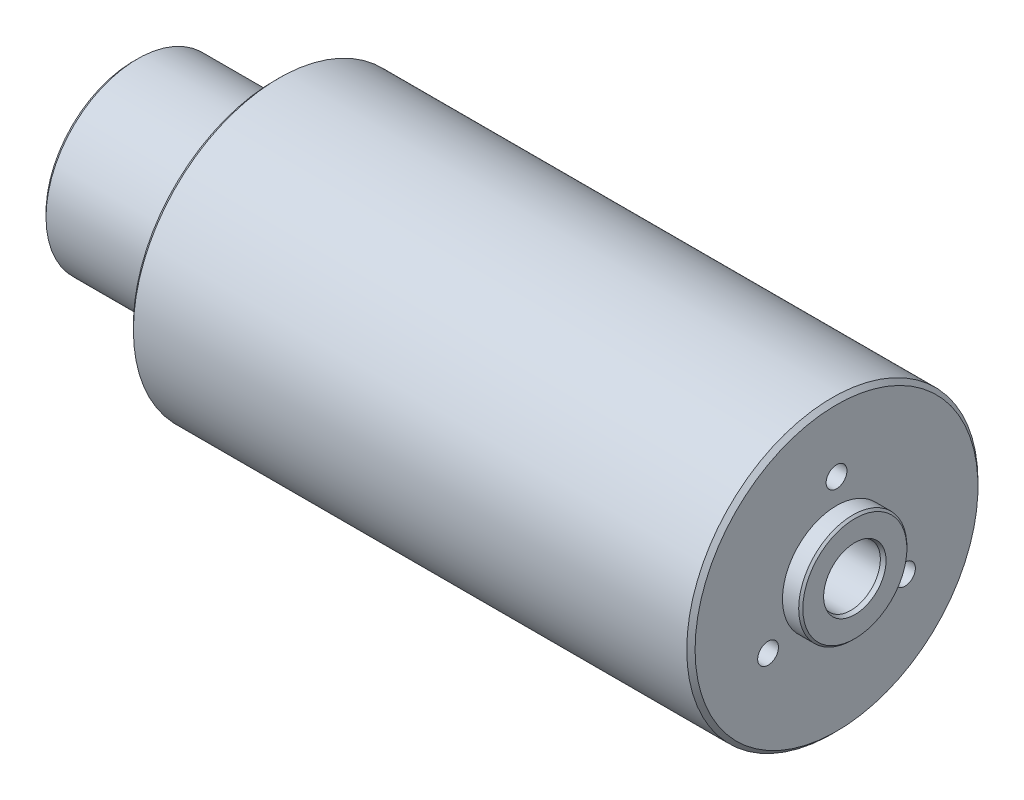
ISO-10303-21;
HEADER;
FILE_DESCRIPTION(('STEP AP214'),'2;1');
FILE_NAME('part.step','',(''),(''),'','','');
FILE_SCHEMA(('AUTOMOTIVE_DESIGN { 1 0 10303 214 1 1 1 1 }'));
ENDSEC;
DATA;
#1=APPLICATION_CONTEXT('core data for automotive mechanical design processes');
#2=APPLICATION_PROTOCOL_DEFINITION('international standard','automotive_design',2000,#1);
#3=PRODUCT_CONTEXT('',#1,'mechanical');
#4=PRODUCT('Part','Part','',(#3));
#5=PRODUCT_RELATED_PRODUCT_CATEGORY('part','',(#4));
#6=PRODUCT_DEFINITION_FORMATION('','',#4);
#7=PRODUCT_DEFINITION_CONTEXT('part definition',#1,'design');
#8=PRODUCT_DEFINITION('design','',#6,#7);
#9=PRODUCT_DEFINITION_SHAPE('','',#8);
#10=(LENGTH_UNIT() NAMED_UNIT(*) SI_UNIT(.MILLI.,.METRE.));
#11=(NAMED_UNIT(*) PLANE_ANGLE_UNIT() SI_UNIT($,.RADIAN.));
#12=(NAMED_UNIT(*) SI_UNIT($,.STERADIAN.) SOLID_ANGLE_UNIT());
#13=UNCERTAINTY_MEASURE_WITH_UNIT(LENGTH_MEASURE(1.E-05),#10,'distance_accuracy_value','');
#14=(GEOMETRIC_REPRESENTATION_CONTEXT(3) GLOBAL_UNCERTAINTY_ASSIGNED_CONTEXT((#13)) GLOBAL_UNIT_ASSIGNED_CONTEXT((#10,
#11,#12)) REPRESENTATION_CONTEXT('',''));
#15=CARTESIAN_POINT('',(0.,0.,0.));
#16=DIRECTION('',(0.,0.,1.));
#17=DIRECTION('',(1.,0.,0.));
#18=AXIS2_PLACEMENT_3D('',#15,#16,#17);
#19=CARTESIAN_POINT('',(-84.5007135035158,11.,0.));
#20=DIRECTION('',(1.,0.,0.));
#21=DIRECTION('',(0.,0.,-1.));
#22=AXIS2_PLACEMENT_3D('',#19,#20,#21);
#23=PLANE('',#22);
#24=CARTESIAN_POINT('',(-84.5007135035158,0.,0.));
#25=DIRECTION('',(1.,0.,0.));
#26=DIRECTION('',(0.,0.,-1.));
#27=AXIS2_PLACEMENT_3D('',#24,#25,#26);
#28=CIRCLE('',#27,10.5);
#29=CARTESIAN_POINT('',(-84.5007135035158,0.,-10.5));
#30=VERTEX_POINT('',#29);
#31=EDGE_CURVE('E119',#30,#30,#28,.F.);
#32=ORIENTED_EDGE('',*,*,#31,.T.);
#33=EDGE_LOOP('',(#32));
#34=FACE_BOUND('',#33,.T.);
#35=ADVANCED_FACE('F34',(#34),#23,.F.);
#36=CARTESIAN_POINT('',(-71.1251521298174,0.,0.));
#37=DIRECTION('',(-1.,0.,0.));
#38=DIRECTION('',(0.,0.,1.));
#39=AXIS2_PLACEMENT_3D('',#36,#37,#38);
#40=CYLINDRICAL_SURFACE('',#39,11.);
#41=CARTESIAN_POINT('',(-84.0007135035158,0.,0.));
#42=DIRECTION('',(1.,0.,0.));
#43=DIRECTION('',(0.,0.,-1.));
#44=AXIS2_PLACEMENT_3D('',#41,#42,#43);
#45=CIRCLE('',#44,11.);
#46=CARTESIAN_POINT('',(-84.0007135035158,0.,-11.));
#47=VERTEX_POINT('',#46);
#48=EDGE_CURVE('E122',#47,#47,#45,.T.);
#49=ORIENTED_EDGE('',*,*,#48,.T.);
#50=EDGE_LOOP('',(#49));
#51=FACE_BOUND('',#50,.T.);
#52=CARTESIAN_POINT('',(-67.5007135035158,0.,0.));
#53=DIRECTION('',(-1.,0.,0.));
#54=DIRECTION('',(0.,0.,1.));
#55=AXIS2_PLACEMENT_3D('',#52,#53,#54);
#56=CIRCLE('',#55,11.);
#57=CARTESIAN_POINT('',(-67.5007135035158,0.,11.));
#58=VERTEX_POINT('',#57);
#59=EDGE_CURVE('E110',#58,#58,#56,.T.);
#60=ORIENTED_EDGE('',*,*,#59,.T.);
#61=EDGE_LOOP('',(#60));
#62=FACE_BOUND('',#61,.T.);
#63=ADVANCED_FACE('F146',(#51,#62),#40,.T.);
#64=CARTESIAN_POINT('',(-67.5007135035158,17.5,0.));
#65=DIRECTION('',(1.,0.,0.));
#66=DIRECTION('',(0.,0.,-1.));
#67=AXIS2_PLACEMENT_3D('',#64,#65,#66);
#68=PLANE('',#67);
#69=CARTESIAN_POINT('',(-67.5007135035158,0.,0.));
#70=DIRECTION('',(1.,0.,0.));
#71=DIRECTION('',(0.,0.,-1.));
#72=AXIS2_PLACEMENT_3D('',#69,#70,#71);
#73=CIRCLE('',#72,17.);
#74=CARTESIAN_POINT('',(-67.5007135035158,0.,-17.));
#75=VERTEX_POINT('',#74);
#76=EDGE_CURVE('E125',#75,#75,#73,.F.);
#77=ORIENTED_EDGE('',*,*,#76,.T.);
#78=EDGE_LOOP('',(#77));
#79=FACE_BOUND('',#78,.T.);
#80=ORIENTED_EDGE('',*,*,#59,.F.);
#81=EDGE_LOOP('',(#80));
#82=FACE_BOUND('',#81,.T.);
#83=ADVANCED_FACE('F143',(#79,#82),#68,.F.);
#84=CARTESIAN_POINT('',(-71.1251521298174,0.,0.));
#85=DIRECTION('',(-1.,0.,0.));
#86=DIRECTION('',(0.,0.,1.));
#87=AXIS2_PLACEMENT_3D('',#84,#85,#86);
#88=CYLINDRICAL_SURFACE('',#87,17.5);
#89=CARTESIAN_POINT('',(-67.0007135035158,0.,0.));
#90=DIRECTION('',(1.,0.,0.));
#91=DIRECTION('',(0.,0.,-1.));
#92=AXIS2_PLACEMENT_3D('',#89,#90,#91);
#93=CIRCLE('',#92,17.5);
#94=CARTESIAN_POINT('',(-67.0007135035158,0.,-17.5));
#95=VERTEX_POINT('',#94);
#96=EDGE_CURVE('E41',#95,#95,#93,.T.);
#97=ORIENTED_EDGE('',*,*,#96,.T.);
#98=EDGE_LOOP('',(#97));
#99=FACE_BOUND('',#98,.T.);
#100=CARTESIAN_POINT('',(-0.5,0.,0.));
#101=DIRECTION('',(-1.,0.,0.));
#102=DIRECTION('',(0.,0.,1.));
#103=AXIS2_PLACEMENT_3D('',#100,#101,#102);
#104=CIRCLE('',#103,17.5);
#105=CARTESIAN_POINT('',(-0.5,0.,17.5));
#106=VERTEX_POINT('',#105);
#107=EDGE_CURVE('E128',#106,#106,#104,.T.);
#108=ORIENTED_EDGE('',*,*,#107,.T.);
#109=EDGE_LOOP('',(#108));
#110=FACE_BOUND('',#109,.T.);
#111=ADVANCED_FACE('F133',(#99,#110),#88,.T.);
#112=CARTESIAN_POINT('',(0.,6.5,0.));
#113=DIRECTION('',(-1.,0.,0.));
#114=DIRECTION('',(0.,0.,1.));
#115=AXIS2_PLACEMENT_3D('',#112,#113,#114);
#116=PLANE('',#115);
#117=CARTESIAN_POINT('',(0.,0.,0.));
#118=DIRECTION('',(-1.,0.,0.));
#119=DIRECTION('',(0.,0.,1.));
#120=AXIS2_PLACEMENT_3D('',#117,#118,#119);
#121=CIRCLE('',#120,17.);
#122=CARTESIAN_POINT('',(0.,0.,17.));
#123=VERTEX_POINT('',#122);
#124=EDGE_CURVE('E11',#123,#123,#121,.F.);
#125=ORIENTED_EDGE('',*,*,#124,.T.);
#126=EDGE_LOOP('',(#125));
#127=FACE_BOUND('',#126,.T.);
#128=CARTESIAN_POINT('',(0.,-4.74999999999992,8.22724133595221));
#129=DIRECTION('',(1.,0.,0.));
#130=DIRECTION('',(0.,0.,-1.));
#131=AXIS2_PLACEMENT_3D('',#128,#129,#130);
#132=CIRCLE('',#131,1.25);
#133=CARTESIAN_POINT('',(0.,-4.74999999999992,6.97724133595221));
#134=VERTEX_POINT('',#133);
#135=EDGE_CURVE('E80',#134,#134,#132,.T.);
#136=ORIENTED_EDGE('',*,*,#135,.F.);
#137=EDGE_LOOP('',(#136));
#138=FACE_BOUND('',#137,.T.);
#139=CARTESIAN_POINT('',(0.,-4.75000000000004,-8.22724133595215));
#140=DIRECTION('',(1.,0.,0.));
#141=DIRECTION('',(0.,0.,-1.));
#142=AXIS2_PLACEMENT_3D('',#139,#140,#141);
#143=CIRCLE('',#142,1.25);
#144=CARTESIAN_POINT('',(0.,-4.75000000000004,-9.47724133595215));
#145=VERTEX_POINT('',#144);
#146=EDGE_CURVE('E92',#145,#145,#143,.T.);
#147=ORIENTED_EDGE('',*,*,#146,.F.);
#148=EDGE_LOOP('',(#147));
#149=FACE_BOUND('',#148,.T.);
#150=CARTESIAN_POINT('',(0.,9.5,0.));
#151=DIRECTION('',(1.,0.,0.));
#152=DIRECTION('',(0.,0.,-1.));
#153=AXIS2_PLACEMENT_3D('',#150,#151,#152);
#154=CIRCLE('',#153,1.25);
#155=CARTESIAN_POINT('',(0.,9.5,-1.25));
#156=VERTEX_POINT('',#155);
#157=EDGE_CURVE('E104',#156,#156,#154,.T.);
#158=ORIENTED_EDGE('',*,*,#157,.F.);
#159=EDGE_LOOP('',(#158));
#160=FACE_BOUND('',#159,.T.);
#161=CARTESIAN_POINT('',(0.,0.,0.));
#162=DIRECTION('',(-1.,0.,0.));
#163=DIRECTION('',(0.,0.,1.));
#164=AXIS2_PLACEMENT_3D('',#161,#162,#163);
#165=CIRCLE('',#164,6.5);
#166=CARTESIAN_POINT('',(0.,0.,6.5));
#167=VERTEX_POINT('',#166);
#168=EDGE_CURVE('E107',#167,#167,#165,.T.);
#169=ORIENTED_EDGE('',*,*,#168,.T.);
#170=EDGE_LOOP('',(#169));
#171=FACE_BOUND('',#170,.T.);
#172=ADVANCED_FACE('F159',(#127,#138,#149,#160,#171),#116,.F.);
#173=CARTESIAN_POINT('',(-71.1251521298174,0.,0.));
#174=DIRECTION('',(-1.,0.,0.));
#175=DIRECTION('',(0.,0.,1.));
#176=AXIS2_PLACEMENT_3D('',#173,#174,#175);
#177=CYLINDRICAL_SURFACE('',#176,6.5);
#178=CARTESIAN_POINT('',(1.95000000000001,0.,0.));
#179=DIRECTION('',(-1.,0.,0.));
#180=DIRECTION('',(0.,0.,1.));
#181=AXIS2_PLACEMENT_3D('',#178,#179,#180);
#182=CIRCLE('',#181,6.5);
#183=CARTESIAN_POINT('',(1.95000000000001,0.,6.5));
#184=VERTEX_POINT('',#183);
#185=EDGE_CURVE('E113',#184,#184,#182,.T.);
#186=ORIENTED_EDGE('',*,*,#185,.T.);
#187=EDGE_LOOP('',(#186));
#188=FACE_BOUND('',#187,.T.);
#189=ORIENTED_EDGE('',*,*,#168,.F.);
#190=EDGE_LOOP('',(#189));
#191=FACE_BOUND('',#190,.T.);
#192=ADVANCED_FACE('F162',(#188,#191),#177,.T.);
#193=CARTESIAN_POINT('',(2.2,0.,0.));
#194=DIRECTION('',(-1.,0.,0.));
#195=DIRECTION('',(0.,0.,1.));
#196=AXIS2_PLACEMENT_3D('',#193,#194,#195);
#197=PLANE('',#196);
#198=CARTESIAN_POINT('',(2.2,0.,0.));
#199=DIRECTION('',(1.,0.,0.));
#200=DIRECTION('',(0.,0.,-1.));
#201=AXIS2_PLACEMENT_3D('',#198,#199,#200);
#202=CIRCLE('',#201,3.75);
#203=CARTESIAN_POINT('',(2.2,0.,-3.75));
#204=VERTEX_POINT('',#203);
#205=EDGE_CURVE('E71',#204,#204,#202,.T.);
#206=ORIENTED_EDGE('',*,*,#205,.F.);
#207=EDGE_LOOP('',(#206));
#208=FACE_BOUND('',#207,.T.);
#209=CARTESIAN_POINT('',(2.2,0.,0.));
#210=DIRECTION('',(-1.,0.,0.));
#211=DIRECTION('',(0.,0.,1.));
#212=AXIS2_PLACEMENT_3D('',#209,#210,#211);
#213=CIRCLE('',#212,6.25000000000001);
#214=CARTESIAN_POINT('',(2.2,0.,6.25000000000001));
#215=VERTEX_POINT('',#214);
#216=EDGE_CURVE('E116',#215,#215,#213,.F.);
#217=ORIENTED_EDGE('',*,*,#216,.T.);
#218=EDGE_LOOP('',(#217));
#219=FACE_BOUND('',#218,.T.);
#220=ADVANCED_FACE('F166',(#208,#219),#197,.F.);
#221=CARTESIAN_POINT('',(1.95000000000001,0.,0.));
#222=DIRECTION('',(-1.,0.,0.));
#223=DIRECTION('',(0.,0.,1.));
#224=AXIS2_PLACEMENT_3D('',#221,#222,#223);
#225=CONICAL_SURFACE('',#224,6.5,0.78539816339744);
#226=ORIENTED_EDGE('',*,*,#216,.F.);
#227=EDGE_LOOP('',(#226));
#228=FACE_BOUND('',#227,.T.);
#229=ORIENTED_EDGE('',*,*,#185,.F.);
#230=EDGE_LOOP('',(#229));
#231=FACE_BOUND('',#230,.T.);
#232=ADVANCED_FACE('F170',(#228,#231),#225,.T.);
#233=CARTESIAN_POINT('',(0.,9.5,0.));
#234=DIRECTION('',(1.,0.,0.));
#235=DIRECTION('',(0.,0.,-1.));
#236=AXIS2_PLACEMENT_3D('',#233,#234,#235);
#237=CYLINDRICAL_SURFACE('',#236,1.25);
#238=CARTESIAN_POINT('',(-4.5,9.5,0.));
#239=DIRECTION('',(1.,0.,0.));
#240=DIRECTION('',(0.,0.,-1.));
#241=AXIS2_PLACEMENT_3D('',#238,#239,#240);
#242=CIRCLE('',#241,1.25);
#243=CARTESIAN_POINT('',(-4.5,9.5,-1.25));
#244=VERTEX_POINT('',#243);
#245=EDGE_CURVE('E101',#244,#244,#242,.T.);
#246=ORIENTED_EDGE('',*,*,#245,.F.);
#247=EDGE_LOOP('',(#246));
#248=FACE_BOUND('',#247,.T.);
#249=ORIENTED_EDGE('',*,*,#157,.T.);
#250=EDGE_LOOP('',(#249));
#251=FACE_BOUND('',#250,.T.);
#252=ADVANCED_FACE('F174',(#248,#251),#237,.F.);
#253=CARTESIAN_POINT('',(-4.5,10.525,0.));
#254=DIRECTION('',(-1.,0.,0.));
#255=DIRECTION('',(0.,0.,1.));
#256=AXIS2_PLACEMENT_3D('',#253,#254,#255);
#257=PLANE('',#256);
#258=CARTESIAN_POINT('',(-4.5,9.5,0.));
#259=DIRECTION('',(1.,0.,0.));
#260=DIRECTION('',(0.,0.,-1.));
#261=AXIS2_PLACEMENT_3D('',#258,#259,#260);
#262=CIRCLE('',#261,1.025);
#263=CARTESIAN_POINT('',(-4.5,9.5,-1.025));
#264=VERTEX_POINT('',#263);
#265=EDGE_CURVE('E98',#264,#264,#262,.T.);
#266=ORIENTED_EDGE('',*,*,#265,.F.);
#267=EDGE_LOOP('',(#266));
#268=FACE_BOUND('',#267,.T.);
#269=ORIENTED_EDGE('',*,*,#245,.T.);
#270=EDGE_LOOP('',(#269));
#271=FACE_BOUND('',#270,.T.);
#272=ADVANCED_FACE('F178',(#268,#271),#257,.F.);
#273=CARTESIAN_POINT('',(0.,9.5,0.));
#274=DIRECTION('',(1.,0.,0.));
#275=DIRECTION('',(0.,0.,-1.));
#276=AXIS2_PLACEMENT_3D('',#273,#274,#275);
#277=CYLINDRICAL_SURFACE('',#276,1.025);
#278=CARTESIAN_POINT('',(-6.75,9.5,0.));
#279=DIRECTION('',(1.,0.,0.));
#280=DIRECTION('',(0.,0.,-1.));
#281=AXIS2_PLACEMENT_3D('',#278,#279,#280);
#282=CIRCLE('',#281,1.025);
#283=CARTESIAN_POINT('',(-6.75,9.5,-1.025));
#284=VERTEX_POINT('',#283);
#285=EDGE_CURVE('E95',#284,#284,#282,.T.);
#286=ORIENTED_EDGE('',*,*,#285,.F.);
#287=EDGE_LOOP('',(#286));
#288=FACE_BOUND('',#287,.T.);
#289=ORIENTED_EDGE('',*,*,#265,.T.);
#290=EDGE_LOOP('',(#289));
#291=FACE_BOUND('',#290,.T.);
#292=ADVANCED_FACE('F182',(#288,#291),#277,.F.);
#293=CARTESIAN_POINT('',(-6.75,9.5,0.));
#294=DIRECTION('',(1.,0.,0.));
#295=DIRECTION('',(0.,0.,-1.));
#296=AXIS2_PLACEMENT_3D('',#293,#294,#295);
#297=CONICAL_SURFACE('',#296,1.025,1.02974425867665);
#298=CARTESIAN_POINT('',(-7.36588213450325,9.5,0.));
#299=VERTEX_POINT('',#298);
#300=VERTEX_LOOP('',#299);
#301=FACE_BOUND('',#300,.T.);
#302=ORIENTED_EDGE('',*,*,#285,.T.);
#303=EDGE_LOOP('',(#302));
#304=FACE_BOUND('',#303,.T.);
#305=ADVANCED_FACE('F186',(#301,#304),#297,.F.);
#306=CARTESIAN_POINT('',(0.,-4.75000000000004,-8.22724133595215));
#307=DIRECTION('',(1.,0.,0.));
#308=DIRECTION('',(0.,0.,-1.));
#309=AXIS2_PLACEMENT_3D('',#306,#307,#308);
#310=CYLINDRICAL_SURFACE('',#309,1.25);
#311=CARTESIAN_POINT('',(-4.5,-4.75000000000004,-8.22724133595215));
#312=DIRECTION('',(1.,0.,0.));
#313=DIRECTION('',(0.,0.,-1.));
#314=AXIS2_PLACEMENT_3D('',#311,#312,#313);
#315=CIRCLE('',#314,1.25);
#316=CARTESIAN_POINT('',(-4.5,-4.75000000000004,-9.47724133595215));
#317=VERTEX_POINT('',#316);
#318=EDGE_CURVE('E89',#317,#317,#315,.T.);
#319=ORIENTED_EDGE('',*,*,#318,.F.);
#320=EDGE_LOOP('',(#319));
#321=FACE_BOUND('',#320,.T.);
#322=ORIENTED_EDGE('',*,*,#146,.T.);
#323=EDGE_LOOP('',(#322));
#324=FACE_BOUND('',#323,.T.);
#325=ADVANCED_FACE('F190',(#321,#324),#310,.F.);
#326=CARTESIAN_POINT('',(-4.5,-3.72500000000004,-8.22724133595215));
#327=DIRECTION('',(-1.,0.,0.));
#328=DIRECTION('',(0.,0.,1.));
#329=AXIS2_PLACEMENT_3D('',#326,#327,#328);
#330=PLANE('',#329);
#331=CARTESIAN_POINT('',(-4.5,-4.75000000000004,-8.22724133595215));
#332=DIRECTION('',(1.,0.,0.));
#333=DIRECTION('',(0.,0.,-1.));
#334=AXIS2_PLACEMENT_3D('',#331,#332,#333);
#335=CIRCLE('',#334,1.025);
#336=CARTESIAN_POINT('',(-4.5,-4.75000000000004,-9.25224133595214));
#337=VERTEX_POINT('',#336);
#338=EDGE_CURVE('E86',#337,#337,#335,.T.);
#339=ORIENTED_EDGE('',*,*,#338,.F.);
#340=EDGE_LOOP('',(#339));
#341=FACE_BOUND('',#340,.T.);
#342=ORIENTED_EDGE('',*,*,#318,.T.);
#343=EDGE_LOOP('',(#342));
#344=FACE_BOUND('',#343,.T.);
#345=ADVANCED_FACE('F193',(#341,#344),#330,.F.);
#346=CARTESIAN_POINT('',(0.,-4.75000000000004,-8.22724133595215));
#347=DIRECTION('',(1.,0.,0.));
#348=DIRECTION('',(0.,0.,-1.));
#349=AXIS2_PLACEMENT_3D('',#346,#347,#348);
#350=CYLINDRICAL_SURFACE('',#349,1.025);
#351=CARTESIAN_POINT('',(-6.75,-4.75000000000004,-8.22724133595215));
#352=DIRECTION('',(1.,0.,0.));
#353=DIRECTION('',(0.,0.,-1.));
#354=AXIS2_PLACEMENT_3D('',#351,#352,#353);
#355=CIRCLE('',#354,1.025);
#356=CARTESIAN_POINT('',(-6.75,-4.75000000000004,-9.25224133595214));
#357=VERTEX_POINT('',#356);
#358=EDGE_CURVE('E83',#357,#357,#355,.T.);
#359=ORIENTED_EDGE('',*,*,#358,.F.);
#360=EDGE_LOOP('',(#359));
#361=FACE_BOUND('',#360,.T.);
#362=ORIENTED_EDGE('',*,*,#338,.T.);
#363=EDGE_LOOP('',(#362));
#364=FACE_BOUND('',#363,.T.);
#365=ADVANCED_FACE('F197',(#361,#364),#350,.F.);
#366=CARTESIAN_POINT('',(-6.75,-4.75000000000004,-8.22724133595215));
#367=DIRECTION('',(1.,0.,0.));
#368=DIRECTION('',(0.,0.,-1.));
#369=AXIS2_PLACEMENT_3D('',#366,#367,#368);
#370=CONICAL_SURFACE('',#369,1.025,1.02974425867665);
#371=CARTESIAN_POINT('',(-7.36588213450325,-4.75000000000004,-8.22724133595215));
#372=VERTEX_POINT('',#371);
#373=VERTEX_LOOP('',#372);
#374=FACE_BOUND('',#373,.T.);
#375=ORIENTED_EDGE('',*,*,#358,.T.);
#376=EDGE_LOOP('',(#375));
#377=FACE_BOUND('',#376,.T.);
#378=ADVANCED_FACE('F201',(#374,#377),#370,.F.);
#379=CARTESIAN_POINT('',(0.,-4.74999999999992,8.22724133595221));
#380=DIRECTION('',(1.,0.,0.));
#381=DIRECTION('',(0.,0.,-1.));
#382=AXIS2_PLACEMENT_3D('',#379,#380,#381);
#383=CYLINDRICAL_SURFACE('',#382,1.25);
#384=CARTESIAN_POINT('',(-4.5,-4.74999999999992,8.22724133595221));
#385=DIRECTION('',(1.,0.,0.));
#386=DIRECTION('',(0.,0.,-1.));
#387=AXIS2_PLACEMENT_3D('',#384,#385,#386);
#388=CIRCLE('',#387,1.25);
#389=CARTESIAN_POINT('',(-4.5,-4.74999999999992,6.97724133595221));
#390=VERTEX_POINT('',#389);
#391=EDGE_CURVE('E77',#390,#390,#388,.T.);
#392=ORIENTED_EDGE('',*,*,#391,.F.);
#393=EDGE_LOOP('',(#392));
#394=FACE_BOUND('',#393,.T.);
#395=ORIENTED_EDGE('',*,*,#135,.T.);
#396=EDGE_LOOP('',(#395));
#397=FACE_BOUND('',#396,.T.);
#398=ADVANCED_FACE('F205',(#394,#397),#383,.F.);
#399=CARTESIAN_POINT('',(-4.5,-3.72499999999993,8.22724133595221));
#400=DIRECTION('',(-1.,0.,0.));
#401=DIRECTION('',(0.,0.,1.));
#402=AXIS2_PLACEMENT_3D('',#399,#400,#401);
#403=PLANE('',#402);
#404=CARTESIAN_POINT('',(-4.5,-4.74999999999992,8.22724133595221));
#405=DIRECTION('',(1.,0.,0.));
#406=DIRECTION('',(0.,0.,-1.));
#407=AXIS2_PLACEMENT_3D('',#404,#405,#406);
#408=CIRCLE('',#407,1.025);
#409=CARTESIAN_POINT('',(-4.5,-4.74999999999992,7.20224133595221));
#410=VERTEX_POINT('',#409);
#411=EDGE_CURVE('E68',#410,#410,#408,.T.);
#412=ORIENTED_EDGE('',*,*,#411,.F.);
#413=EDGE_LOOP('',(#412));
#414=FACE_BOUND('',#413,.T.);
#415=ORIENTED_EDGE('',*,*,#391,.T.);
#416=EDGE_LOOP('',(#415));
#417=FACE_BOUND('',#416,.T.);
#418=ADVANCED_FACE('F208',(#414,#417),#403,.F.);
#419=CARTESIAN_POINT('',(0.,-4.74999999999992,8.22724133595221));
#420=DIRECTION('',(1.,0.,0.));
#421=DIRECTION('',(0.,0.,-1.));
#422=AXIS2_PLACEMENT_3D('',#419,#420,#421);
#423=CYLINDRICAL_SURFACE('',#422,1.025);
#424=CARTESIAN_POINT('',(-6.75,-4.74999999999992,8.22724133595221));
#425=DIRECTION('',(1.,0.,0.));
#426=DIRECTION('',(0.,0.,-1.));
#427=AXIS2_PLACEMENT_3D('',#424,#425,#426);
#428=CIRCLE('',#427,1.025);
#429=CARTESIAN_POINT('',(-6.75,-4.74999999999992,7.20224133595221));
#430=VERTEX_POINT('',#429);
#431=EDGE_CURVE('E64',#430,#430,#428,.T.);
#432=ORIENTED_EDGE('',*,*,#431,.F.);
#433=EDGE_LOOP('',(#432));
#434=FACE_BOUND('',#433,.T.);
#435=ORIENTED_EDGE('',*,*,#411,.T.);
#436=EDGE_LOOP('',(#435));
#437=FACE_BOUND('',#436,.T.);
#438=ADVANCED_FACE('F212',(#434,#437),#423,.F.);
#439=CARTESIAN_POINT('',(-6.75,-4.74999999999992,8.22724133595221));
#440=DIRECTION('',(1.,0.,0.));
#441=DIRECTION('',(0.,0.,-1.));
#442=AXIS2_PLACEMENT_3D('',#439,#440,#441);
#443=CONICAL_SURFACE('',#442,1.025,1.02974425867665);
#444=CARTESIAN_POINT('',(-7.36588213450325,-4.74999999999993,8.22724133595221));
#445=VERTEX_POINT('',#444);
#446=VERTEX_LOOP('',#445);
#447=FACE_BOUND('',#446,.T.);
#448=ORIENTED_EDGE('',*,*,#431,.T.);
#449=EDGE_LOOP('',(#448));
#450=FACE_BOUND('',#449,.T.);
#451=ADVANCED_FACE('F216',(#447,#450),#443,.F.);
#452=CARTESIAN_POINT('',(-84.5007135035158,0.,0.));
#453=DIRECTION('',(1.,0.,0.));
#454=DIRECTION('',(0.,0.,-1.));
#455=AXIS2_PLACEMENT_3D('',#452,#453,#454);
#456=CONICAL_SURFACE('',#455,10.5,0.785398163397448);
#457=ORIENTED_EDGE('',*,*,#48,.F.);
#458=EDGE_LOOP('',(#457));
#459=FACE_BOUND('',#458,.T.);
#460=ORIENTED_EDGE('',*,*,#31,.F.);
#461=EDGE_LOOP('',(#460));
#462=FACE_BOUND('',#461,.T.);
#463=ADVANCED_FACE('F139',(#459,#462),#456,.T.);
#464=CARTESIAN_POINT('',(-67.5007135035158,0.,0.));
#465=DIRECTION('',(1.,0.,0.));
#466=DIRECTION('',(0.,0.,-1.));
#467=AXIS2_PLACEMENT_3D('',#464,#465,#466);
#468=CONICAL_SURFACE('',#467,17.,0.785398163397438);
#469=ORIENTED_EDGE('',*,*,#96,.F.);
#470=EDGE_LOOP('',(#469));
#471=FACE_BOUND('',#470,.T.);
#472=ORIENTED_EDGE('',*,*,#76,.F.);
#473=EDGE_LOOP('',(#472));
#474=FACE_BOUND('',#473,.T.);
#475=ADVANCED_FACE('F136',(#471,#474),#468,.T.);
#476=CARTESIAN_POINT('',(-0.5,0.,0.));
#477=DIRECTION('',(-1.,0.,0.));
#478=DIRECTION('',(0.,0.,1.));
#479=AXIS2_PLACEMENT_3D('',#476,#477,#478);
#480=CONICAL_SURFACE('',#479,17.5,0.785398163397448);
#481=ORIENTED_EDGE('',*,*,#124,.F.);
#482=EDGE_LOOP('',(#481));
#483=FACE_BOUND('',#482,.T.);
#484=ORIENTED_EDGE('',*,*,#107,.F.);
#485=EDGE_LOOP('',(#484));
#486=FACE_BOUND('',#485,.T.);
#487=ADVANCED_FACE('F58',(#483,#486),#480,.T.);
#488=CARTESIAN_POINT('',(-17.8,0.,0.));
#489=DIRECTION('',(1.,0.,0.));
#490=DIRECTION('',(0.,0.,-1.));
#491=AXIS2_PLACEMENT_3D('',#488,#489,#490);
#492=CONICAL_SURFACE('',#491,3.54999999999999,1.02974425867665);
#493=CARTESIAN_POINT('',(-19.9330551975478,0.,0.));
#494=VERTEX_POINT('',#493);
#495=VERTEX_LOOP('',#494);
#496=FACE_BOUND('',#495,.T.);
#497=CARTESIAN_POINT('',(-17.8,0.,0.));
#498=DIRECTION('',(1.,0.,0.));
#499=DIRECTION('',(0.,0.,-1.));
#500=AXIS2_PLACEMENT_3D('',#497,#498,#499);
#501=CIRCLE('',#500,3.54999999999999);
#502=CARTESIAN_POINT('',(-17.8,0.,-3.54999999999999));
#503=VERTEX_POINT('',#502);
#504=EDGE_CURVE('E62',#503,#503,#501,.T.);
#505=ORIENTED_EDGE('',*,*,#504,.T.);
#506=EDGE_LOOP('',(#505));
#507=FACE_BOUND('',#506,.T.);
#508=ADVANCED_FACE('F54',(#496,#507),#492,.F.);
#509=CARTESIAN_POINT('',(2.2,0.,0.));
#510=DIRECTION('',(1.,0.,0.));
#511=DIRECTION('',(0.,0.,-1.));
#512=AXIS2_PLACEMENT_3D('',#509,#510,#511);
#513=CYLINDRICAL_SURFACE('',#512,3.54999999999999);
#514=ORIENTED_EDGE('',*,*,#504,.F.);
#515=EDGE_LOOP('',(#514));
#516=FACE_BOUND('',#515,.T.);
#517=CARTESIAN_POINT('',(1.71715728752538,0.,0.));
#518=DIRECTION('',(1.,0.,0.));
#519=DIRECTION('',(0.,0.,-1.));
#520=AXIS2_PLACEMENT_3D('',#517,#518,#519);
#521=CIRCLE('',#520,3.55);
#522=CARTESIAN_POINT('',(1.71715728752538,0.,-3.55));
#523=VERTEX_POINT('',#522);
#524=EDGE_CURVE('E65',#523,#523,#521,.T.);
#525=ORIENTED_EDGE('',*,*,#524,.T.);
#526=EDGE_LOOP('',(#525));
#527=FACE_BOUND('',#526,.T.);
#528=ADVANCED_FACE('F57',(#516,#527),#513,.F.);
#529=CARTESIAN_POINT('',(2.2,0.,0.));
#530=DIRECTION('',(1.,0.,0.));
#531=DIRECTION('',(0.,0.,-1.));
#532=AXIS2_PLACEMENT_3D('',#529,#530,#531);
#533=CONICAL_SURFACE('',#532,3.75,0.392699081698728);
#534=ORIENTED_EDGE('',*,*,#524,.F.);
#535=EDGE_LOOP('',(#534));
#536=FACE_BOUND('',#535,.T.);
#537=ORIENTED_EDGE('',*,*,#205,.T.);
#538=EDGE_LOOP('',(#537));
#539=FACE_BOUND('',#538,.T.);
#540=ADVANCED_FACE('F229',(#536,#539),#533,.F.);
#541=CLOSED_SHELL('',(#35,#63,#83,#111,#172,#192,#220,#232,#252,#272,#292,#305,#325,#345,#365,
#378,#398,#418,#438,#451,#463,#475,#487,#508,#528,#540));
#542=MANIFOLD_SOLID_BREP('B2',#541);
#543=ADVANCED_BREP_SHAPE_REPRESENTATION('',(#18,#542),#14);
#544=SHAPE_DEFINITION_REPRESENTATION(#9,#543);
ENDSEC;
END-ISO-10303-21;
